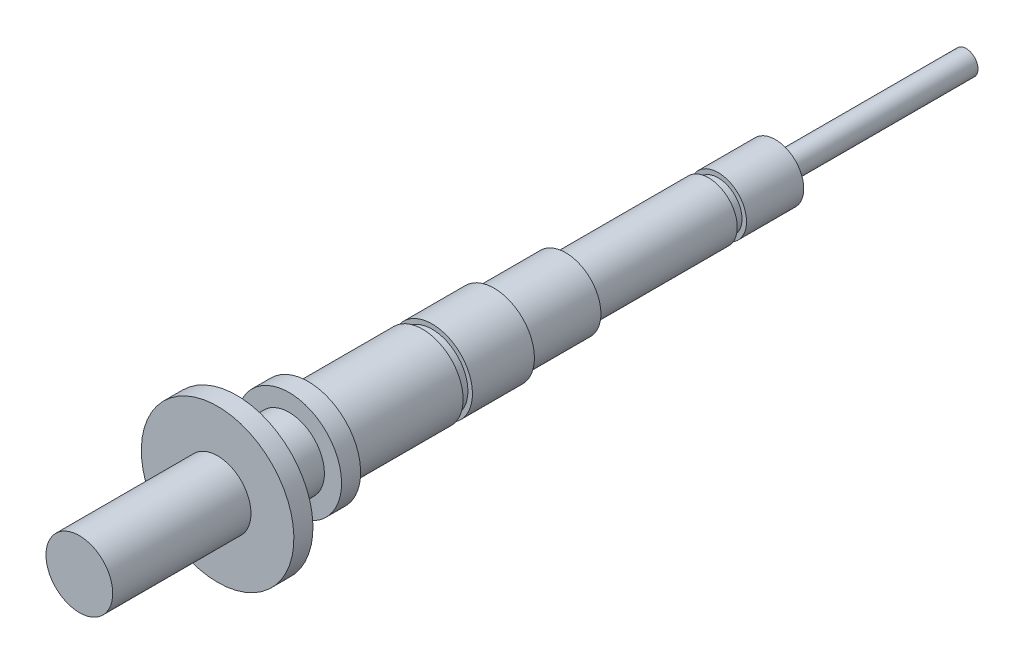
ISO-10303-21;
HEADER;
FILE_DESCRIPTION(('STEP AP214'),'2;1');
FILE_NAME('part.step','',(''),(''),'','','');
FILE_SCHEMA(('AUTOMOTIVE_DESIGN { 1 0 10303 214 1 1 1 1 }'));
ENDSEC;
DATA;
#1=APPLICATION_CONTEXT('core data for automotive mechanical design processes');
#2=APPLICATION_PROTOCOL_DEFINITION('international standard','automotive_design',2000,#1);
#3=PRODUCT_CONTEXT('',#1,'mechanical');
#4=PRODUCT('Part','Part','',(#3));
#5=PRODUCT_RELATED_PRODUCT_CATEGORY('part','',(#4));
#6=PRODUCT_DEFINITION_FORMATION('','',#4);
#7=PRODUCT_DEFINITION_CONTEXT('part definition',#1,'design');
#8=PRODUCT_DEFINITION('design','',#6,#7);
#9=PRODUCT_DEFINITION_SHAPE('','',#8);
#10=(LENGTH_UNIT() NAMED_UNIT(*) SI_UNIT(.MILLI.,.METRE.));
#11=(NAMED_UNIT(*) PLANE_ANGLE_UNIT() SI_UNIT($,.RADIAN.));
#12=(NAMED_UNIT(*) SI_UNIT($,.STERADIAN.) SOLID_ANGLE_UNIT());
#13=UNCERTAINTY_MEASURE_WITH_UNIT(LENGTH_MEASURE(1.E-05),#10,'distance_accuracy_value','');
#14=(GEOMETRIC_REPRESENTATION_CONTEXT(3) GLOBAL_UNCERTAINTY_ASSIGNED_CONTEXT((#13)) GLOBAL_UNIT_ASSIGNED_CONTEXT((#10,
#11,#12)) REPRESENTATION_CONTEXT('',''));
#15=CARTESIAN_POINT('',(0.,0.,0.));
#16=DIRECTION('',(0.,0.,1.));
#17=DIRECTION('',(1.,0.,0.));
#18=AXIS2_PLACEMENT_3D('',#15,#16,#17);
#19=CARTESIAN_POINT('',(0.,0.,93.));
#20=DIRECTION('',(0.,0.,-1.));
#21=DIRECTION('',(0.,1.,0.));
#22=AXIS2_PLACEMENT_3D('',#19,#20,#21);
#23=PLANE('',#22);
#24=CARTESIAN_POINT('',(0.,0.,93.));
#25=DIRECTION('',(0.,0.,1.));
#26=DIRECTION('',(0.,-1.,0.));
#27=AXIS2_PLACEMENT_3D('',#24,#25,#26);
#28=CIRCLE('',#27,6.99999999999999);
#29=CARTESIAN_POINT('',(0.,-6.99999999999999,93.));
#30=VERTEX_POINT('',#29);
#31=EDGE_CURVE('E10',#30,#30,#28,.T.);
#32=ORIENTED_EDGE('',*,*,#31,.T.);
#33=EDGE_LOOP('',(#32));
#34=FACE_BOUND('',#33,.T.);
#35=ADVANCED_FACE('F37',(#34),#23,.F.);
#36=CARTESIAN_POINT('',(0.,0.,126.394277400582));
#37=DIRECTION('',(0.,0.,1.));
#38=DIRECTION('',(0.,-1.,0.));
#39=AXIS2_PLACEMENT_3D('',#36,#37,#38);
#40=CYLINDRICAL_SURFACE('',#39,6.99999999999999);
#41=ORIENTED_EDGE('',*,*,#31,.F.);
#42=EDGE_LOOP('',(#41));
#43=FACE_BOUND('',#42,.T.);
#44=CARTESIAN_POINT('',(0.,0.,64.));
#45=DIRECTION('',(0.,0.,1.));
#46=DIRECTION('',(0.,-1.,0.));
#47=AXIS2_PLACEMENT_3D('',#44,#45,#46);
#48=CIRCLE('',#47,6.99999999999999);
#49=CARTESIAN_POINT('',(0.,-6.99999999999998,64.));
#50=VERTEX_POINT('',#49);
#51=EDGE_CURVE('E44',#50,#50,#48,.T.);
#52=ORIENTED_EDGE('',*,*,#51,.T.);
#53=EDGE_LOOP('',(#52));
#54=FACE_BOUND('',#53,.T.);
#55=ADVANCED_FACE('F153',(#43,#54),#40,.T.);
#56=CARTESIAN_POINT('',(0.,7.,64.));
#57=DIRECTION('',(0.,0.,-1.));
#58=DIRECTION('',(0.,1.,0.));
#59=AXIS2_PLACEMENT_3D('',#56,#57,#58);
#60=PLANE('',#59);
#61=ORIENTED_EDGE('',*,*,#51,.F.);
#62=EDGE_LOOP('',(#61));
#63=FACE_BOUND('',#62,.T.);
#64=CARTESIAN_POINT('',(0.,0.,64.));
#65=DIRECTION('',(0.,0.,1.));
#66=DIRECTION('',(0.,-1.,0.));
#67=AXIS2_PLACEMENT_3D('',#64,#65,#66);
#68=CIRCLE('',#67,16.);
#69=CARTESIAN_POINT('',(0.,-16.,64.));
#70=VERTEX_POINT('',#69);
#71=EDGE_CURVE('E49',#70,#70,#68,.T.);
#72=ORIENTED_EDGE('',*,*,#71,.T.);
#73=EDGE_LOOP('',(#72));
#74=FACE_BOUND('',#73,.T.);
#75=ADVANCED_FACE('F157',(#63,#74),#60,.F.);
#76=CARTESIAN_POINT('',(0.,0.,126.394277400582));
#77=DIRECTION('',(0.,0.,1.));
#78=DIRECTION('',(0.,-1.,0.));
#79=AXIS2_PLACEMENT_3D('',#76,#77,#78);
#80=CYLINDRICAL_SURFACE('',#79,16.);
#81=ORIENTED_EDGE('',*,*,#71,.F.);
#82=EDGE_LOOP('',(#81));
#83=FACE_BOUND('',#82,.T.);
#84=CARTESIAN_POINT('',(0.,0.,60.));
#85=DIRECTION('',(0.,0.,1.));
#86=DIRECTION('',(0.,-1.,0.));
#87=AXIS2_PLACEMENT_3D('',#84,#85,#86);
#88=CIRCLE('',#87,16.);
#89=CARTESIAN_POINT('',(0.,-16.,60.));
#90=VERTEX_POINT('',#89);
#91=EDGE_CURVE('E54',#90,#90,#88,.T.);
#92=ORIENTED_EDGE('',*,*,#91,.T.);
#93=EDGE_LOOP('',(#92));
#94=FACE_BOUND('',#93,.T.);
#95=ADVANCED_FACE('F162',(#83,#94),#80,.T.);
#96=CARTESIAN_POINT('',(0.,16.,60.));
#97=DIRECTION('',(0.,0.,1.));
#98=DIRECTION('',(0.,-1.,0.));
#99=AXIS2_PLACEMENT_3D('',#96,#97,#98);
#100=PLANE('',#99);
#101=ORIENTED_EDGE('',*,*,#91,.F.);
#102=EDGE_LOOP('',(#101));
#103=FACE_BOUND('',#102,.T.);
#104=CARTESIAN_POINT('',(0.,0.,60.));
#105=DIRECTION('',(0.,0.,1.));
#106=DIRECTION('',(0.,-1.,0.));
#107=AXIS2_PLACEMENT_3D('',#104,#105,#106);
#108=CIRCLE('',#107,7.39999999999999);
#109=CARTESIAN_POINT('',(0.,-7.39999999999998,60.));
#110=VERTEX_POINT('',#109);
#111=EDGE_CURVE('E60',#110,#110,#108,.T.);
#112=ORIENTED_EDGE('',*,*,#111,.T.);
#113=EDGE_LOOP('',(#112));
#114=FACE_BOUND('',#113,.T.);
#115=ADVANCED_FACE('F168',(#103,#114),#100,.F.);
#116=CARTESIAN_POINT('',(0.,0.,126.394277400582));
#117=DIRECTION('',(0.,0.,1.));
#118=DIRECTION('',(0.,-1.,0.));
#119=AXIS2_PLACEMENT_3D('',#116,#117,#118);
#120=CYLINDRICAL_SURFACE('',#119,7.39999999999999);
#121=ORIENTED_EDGE('',*,*,#111,.F.);
#122=EDGE_LOOP('',(#121));
#123=FACE_BOUND('',#122,.T.);
#124=CARTESIAN_POINT('',(0.,0.,49.));
#125=DIRECTION('',(0.,0.,1.));
#126=DIRECTION('',(0.,-1.,0.));
#127=AXIS2_PLACEMENT_3D('',#124,#125,#126);
#128=CIRCLE('',#127,7.39999999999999);
#129=CARTESIAN_POINT('',(0.,-7.39999999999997,49.));
#130=VERTEX_POINT('',#129);
#131=EDGE_CURVE('E64',#130,#130,#128,.T.);
#132=ORIENTED_EDGE('',*,*,#131,.T.);
#133=EDGE_LOOP('',(#132));
#134=FACE_BOUND('',#133,.T.);
#135=ADVANCED_FACE('F172',(#123,#134),#120,.T.);
#136=CARTESIAN_POINT('',(0.,7.4,49.));
#137=DIRECTION('',(0.,0.,-1.));
#138=DIRECTION('',(0.,1.,0.));
#139=AXIS2_PLACEMENT_3D('',#136,#137,#138);
#140=PLANE('',#139);
#141=ORIENTED_EDGE('',*,*,#131,.F.);
#142=EDGE_LOOP('',(#141));
#143=FACE_BOUND('',#142,.T.);
#144=CARTESIAN_POINT('',(0.,0.,49.));
#145=DIRECTION('',(0.,0.,1.));
#146=DIRECTION('',(0.,-1.,0.));
#147=AXIS2_PLACEMENT_3D('',#144,#145,#146);
#148=CIRCLE('',#147,11.);
#149=CARTESIAN_POINT('',(0.,-11.,49.));
#150=VERTEX_POINT('',#149);
#151=EDGE_CURVE('E68',#150,#150,#148,.T.);
#152=ORIENTED_EDGE('',*,*,#151,.T.);
#153=EDGE_LOOP('',(#152));
#154=FACE_BOUND('',#153,.T.);
#155=ADVANCED_FACE('F176',(#143,#154),#140,.F.);
#156=CARTESIAN_POINT('',(0.,0.,126.394277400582));
#157=DIRECTION('',(0.,0.,1.));
#158=DIRECTION('',(0.,-1.,0.));
#159=AXIS2_PLACEMENT_3D('',#156,#157,#158);
#160=CYLINDRICAL_SURFACE('',#159,11.);
#161=ORIENTED_EDGE('',*,*,#151,.F.);
#162=EDGE_LOOP('',(#161));
#163=FACE_BOUND('',#162,.T.);
#164=CARTESIAN_POINT('',(0.,0.,45.));
#165=DIRECTION('',(0.,0.,1.));
#166=DIRECTION('',(0.,-1.,0.));
#167=AXIS2_PLACEMENT_3D('',#164,#165,#166);
#168=CIRCLE('',#167,11.);
#169=CARTESIAN_POINT('',(0.,-11.,45.));
#170=VERTEX_POINT('',#169);
#171=EDGE_CURVE('E72',#170,#170,#168,.T.);
#172=ORIENTED_EDGE('',*,*,#171,.T.);
#173=EDGE_LOOP('',(#172));
#174=FACE_BOUND('',#173,.T.);
#175=ADVANCED_FACE('F180',(#163,#174),#160,.T.);
#176=CARTESIAN_POINT('',(0.,11.,45.));
#177=DIRECTION('',(0.,0.,1.));
#178=DIRECTION('',(0.,-1.,0.));
#179=AXIS2_PLACEMENT_3D('',#176,#177,#178);
#180=PLANE('',#179);
#181=ORIENTED_EDGE('',*,*,#171,.F.);
#182=EDGE_LOOP('',(#181));
#183=FACE_BOUND('',#182,.T.);
#184=CARTESIAN_POINT('',(0.,0.,45.));
#185=DIRECTION('',(0.,0.,1.));
#186=DIRECTION('',(0.,-1.,0.));
#187=AXIS2_PLACEMENT_3D('',#184,#185,#186);
#188=CIRCLE('',#187,8.49999999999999);
#189=CARTESIAN_POINT('',(0.,-8.49999999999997,45.));
#190=VERTEX_POINT('',#189);
#191=EDGE_CURVE('E76',#190,#190,#188,.T.);
#192=ORIENTED_EDGE('',*,*,#191,.T.);
#193=EDGE_LOOP('',(#192));
#194=FACE_BOUND('',#193,.T.);
#195=ADVANCED_FACE('F184',(#183,#194),#180,.F.);
#196=CARTESIAN_POINT('',(0.,0.,126.394277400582));
#197=DIRECTION('',(0.,0.,1.));
#198=DIRECTION('',(0.,-1.,0.));
#199=AXIS2_PLACEMENT_3D('',#196,#197,#198);
#200=CYLINDRICAL_SURFACE('',#199,8.49999999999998);
#201=ORIENTED_EDGE('',*,*,#191,.F.);
#202=EDGE_LOOP('',(#201));
#203=FACE_BOUND('',#202,.T.);
#204=CARTESIAN_POINT('',(0.,0.,21.));
#205=DIRECTION('',(0.,0.,1.));
#206=DIRECTION('',(0.,-1.,0.));
#207=AXIS2_PLACEMENT_3D('',#204,#205,#206);
#208=CIRCLE('',#207,8.49999999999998);
#209=CARTESIAN_POINT('',(0.,-8.49999999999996,21.));
#210=VERTEX_POINT('',#209);
#211=EDGE_CURVE('E80',#210,#210,#208,.T.);
#212=ORIENTED_EDGE('',*,*,#211,.T.);
#213=EDGE_LOOP('',(#212));
#214=FACE_BOUND('',#213,.T.);
#215=ADVANCED_FACE('F188',(#203,#214),#200,.T.);
#216=CARTESIAN_POINT('',(0.,8.45,21.));
#217=DIRECTION('',(0.,0.,1.));
#218=DIRECTION('',(0.,-1.,0.));
#219=AXIS2_PLACEMENT_3D('',#216,#217,#218);
#220=PLANE('',#219);
#221=ORIENTED_EDGE('',*,*,#211,.F.);
#222=EDGE_LOOP('',(#221));
#223=FACE_BOUND('',#222,.T.);
#224=CARTESIAN_POINT('',(0.,0.,21.));
#225=DIRECTION('',(0.,0.,1.));
#226=DIRECTION('',(0.,-1.,0.));
#227=AXIS2_PLACEMENT_3D('',#224,#225,#226);
#228=CIRCLE('',#227,7.49999999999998);
#229=CARTESIAN_POINT('',(0.,-7.49999999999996,21.));
#230=VERTEX_POINT('',#229);
#231=EDGE_CURVE('E84',#230,#230,#228,.T.);
#232=ORIENTED_EDGE('',*,*,#231,.T.);
#233=EDGE_LOOP('',(#232));
#234=FACE_BOUND('',#233,.T.);
#235=ADVANCED_FACE('F192',(#223,#234),#220,.F.);
#236=CARTESIAN_POINT('',(0.,0.,126.394277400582));
#237=DIRECTION('',(0.,0.,1.));
#238=DIRECTION('',(0.,-1.,0.));
#239=AXIS2_PLACEMENT_3D('',#236,#237,#238);
#240=CYLINDRICAL_SURFACE('',#239,7.49999999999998);
#241=ORIENTED_EDGE('',*,*,#231,.F.);
#242=EDGE_LOOP('',(#241));
#243=FACE_BOUND('',#242,.T.);
#244=CARTESIAN_POINT('',(0.,0.,19.));
#245=DIRECTION('',(0.,0.,1.));
#246=DIRECTION('',(0.,-1.,0.));
#247=AXIS2_PLACEMENT_3D('',#244,#245,#246);
#248=CIRCLE('',#247,7.49999999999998);
#249=CARTESIAN_POINT('',(0.,-7.49999999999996,19.));
#250=VERTEX_POINT('',#249);
#251=EDGE_CURVE('E88',#250,#250,#248,.T.);
#252=ORIENTED_EDGE('',*,*,#251,.T.);
#253=EDGE_LOOP('',(#252));
#254=FACE_BOUND('',#253,.T.);
#255=ADVANCED_FACE('F196',(#243,#254),#240,.T.);
#256=CARTESIAN_POINT('',(0.,7.5,19.));
#257=DIRECTION('',(0.,0.,-1.));
#258=DIRECTION('',(0.,1.,0.));
#259=AXIS2_PLACEMENT_3D('',#256,#257,#258);
#260=PLANE('',#259);
#261=ORIENTED_EDGE('',*,*,#251,.F.);
#262=EDGE_LOOP('',(#261));
#263=FACE_BOUND('',#262,.T.);
#264=CARTESIAN_POINT('',(0.,0.,19.));
#265=DIRECTION('',(0.,0.,1.));
#266=DIRECTION('',(0.,-1.,0.));
#267=AXIS2_PLACEMENT_3D('',#264,#265,#266);
#268=CIRCLE('',#267,8.44999999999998);
#269=CARTESIAN_POINT('',(0.,-8.44999999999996,19.));
#270=VERTEX_POINT('',#269);
#271=EDGE_CURVE('E92',#270,#270,#268,.T.);
#272=ORIENTED_EDGE('',*,*,#271,.T.);
#273=EDGE_LOOP('',(#272));
#274=FACE_BOUND('',#273,.T.);
#275=ADVANCED_FACE('F200',(#263,#274),#260,.F.);
#276=CARTESIAN_POINT('',(0.,0.,126.394277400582));
#277=DIRECTION('',(0.,0.,1.));
#278=DIRECTION('',(0.,-1.,0.));
#279=AXIS2_PLACEMENT_3D('',#276,#277,#278);
#280=CYLINDRICAL_SURFACE('',#279,8.44999999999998);
#281=ORIENTED_EDGE('',*,*,#271,.F.);
#282=EDGE_LOOP('',(#281));
#283=FACE_BOUND('',#282,.T.);
#284=CARTESIAN_POINT('',(0.,0.,6.00000000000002));
#285=DIRECTION('',(0.,0.,1.));
#286=DIRECTION('',(0.,-1.,0.));
#287=AXIS2_PLACEMENT_3D('',#284,#285,#286);
#288=CIRCLE('',#287,8.44999999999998);
#289=CARTESIAN_POINT('',(0.,-8.44999999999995,6.00000000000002));
#290=VERTEX_POINT('',#289);
#291=EDGE_CURVE('E96',#290,#290,#288,.T.);
#292=ORIENTED_EDGE('',*,*,#291,.T.);
#293=EDGE_LOOP('',(#292));
#294=FACE_BOUND('',#293,.T.);
#295=ADVANCED_FACE('F204',(#283,#294),#280,.T.);
#296=CARTESIAN_POINT('',(0.,8.45,6.00000000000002));
#297=DIRECTION('',(0.,0.,1.));
#298=DIRECTION('',(0.,-1.,0.));
#299=AXIS2_PLACEMENT_3D('',#296,#297,#298);
#300=PLANE('',#299);
#301=ORIENTED_EDGE('',*,*,#291,.F.);
#302=EDGE_LOOP('',(#301));
#303=FACE_BOUND('',#302,.T.);
#304=CARTESIAN_POINT('',(0.,0.,6.00000000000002));
#305=DIRECTION('',(0.,0.,1.));
#306=DIRECTION('',(0.,-1.,0.));
#307=AXIS2_PLACEMENT_3D('',#304,#305,#306);
#308=CIRCLE('',#307,7.39999999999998);
#309=CARTESIAN_POINT('',(0.,-7.39999999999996,6.00000000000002));
#310=VERTEX_POINT('',#309);
#311=EDGE_CURVE('E100',#310,#310,#308,.T.);
#312=ORIENTED_EDGE('',*,*,#311,.T.);
#313=EDGE_LOOP('',(#312));
#314=FACE_BOUND('',#313,.T.);
#315=ADVANCED_FACE('F208',(#303,#314),#300,.F.);
#316=CARTESIAN_POINT('',(0.,0.,126.394277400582));
#317=DIRECTION('',(0.,0.,1.));
#318=DIRECTION('',(0.,-1.,0.));
#319=AXIS2_PLACEMENT_3D('',#316,#317,#318);
#320=CYLINDRICAL_SURFACE('',#319,7.39999999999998);
#321=ORIENTED_EDGE('',*,*,#311,.F.);
#322=EDGE_LOOP('',(#321));
#323=FACE_BOUND('',#322,.T.);
#324=CARTESIAN_POINT('',(0.,0.,-9.00000000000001));
#325=DIRECTION('',(0.,0.,1.));
#326=DIRECTION('',(0.,-1.,0.));
#327=AXIS2_PLACEMENT_3D('',#324,#325,#326);
#328=CIRCLE('',#327,7.39999999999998);
#329=CARTESIAN_POINT('',(0.,-7.39999999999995,-9.00000000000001));
#330=VERTEX_POINT('',#329);
#331=EDGE_CURVE('E104',#330,#330,#328,.T.);
#332=ORIENTED_EDGE('',*,*,#331,.T.);
#333=EDGE_LOOP('',(#332));
#334=FACE_BOUND('',#333,.T.);
#335=ADVANCED_FACE('F212',(#323,#334),#320,.T.);
#336=CARTESIAN_POINT('',(0.,7.4,-9.00000000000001));
#337=DIRECTION('',(0.,0.,1.));
#338=DIRECTION('',(0.,-1.,0.));
#339=AXIS2_PLACEMENT_3D('',#336,#337,#338);
#340=PLANE('',#339);
#341=ORIENTED_EDGE('',*,*,#331,.F.);
#342=EDGE_LOOP('',(#341));
#343=FACE_BOUND('',#342,.T.);
#344=CARTESIAN_POINT('',(0.,0.,-9.00000000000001));
#345=DIRECTION('',(0.,0.,1.));
#346=DIRECTION('',(0.,-1.,0.));
#347=AXIS2_PLACEMENT_3D('',#344,#345,#346);
#348=CIRCLE('',#347,5.99999999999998);
#349=CARTESIAN_POINT('',(0.,-5.99999999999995,-9.00000000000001));
#350=VERTEX_POINT('',#349);
#351=EDGE_CURVE('E108',#350,#350,#348,.T.);
#352=ORIENTED_EDGE('',*,*,#351,.T.);
#353=EDGE_LOOP('',(#352));
#354=FACE_BOUND('',#353,.T.);
#355=ADVANCED_FACE('F216',(#343,#354),#340,.F.);
#356=CARTESIAN_POINT('',(0.,0.,126.394277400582));
#357=DIRECTION('',(0.,0.,1.));
#358=DIRECTION('',(0.,-1.,0.));
#359=AXIS2_PLACEMENT_3D('',#356,#357,#358);
#360=CYLINDRICAL_SURFACE('',#359,5.99999999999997);
#361=ORIENTED_EDGE('',*,*,#351,.F.);
#362=EDGE_LOOP('',(#361));
#363=FACE_BOUND('',#362,.T.);
#364=CARTESIAN_POINT('',(0.,0.,-39.));
#365=DIRECTION('',(0.,0.,1.));
#366=DIRECTION('',(0.,-1.,0.));
#367=AXIS2_PLACEMENT_3D('',#364,#365,#366);
#368=CIRCLE('',#367,5.99999999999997);
#369=CARTESIAN_POINT('',(0.,-5.99999999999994,-39.));
#370=VERTEX_POINT('',#369);
#371=EDGE_CURVE('E112',#370,#370,#368,.T.);
#372=ORIENTED_EDGE('',*,*,#371,.T.);
#373=EDGE_LOOP('',(#372));
#374=FACE_BOUND('',#373,.T.);
#375=ADVANCED_FACE('F220',(#363,#374),#360,.T.);
#376=CARTESIAN_POINT('',(0.,6.,-39.));
#377=DIRECTION('',(0.,0.,1.));
#378=DIRECTION('',(0.,-1.,0.));
#379=AXIS2_PLACEMENT_3D('',#376,#377,#378);
#380=PLANE('',#379);
#381=ORIENTED_EDGE('',*,*,#371,.F.);
#382=EDGE_LOOP('',(#381));
#383=FACE_BOUND('',#382,.T.);
#384=CARTESIAN_POINT('',(0.,0.,-39.));
#385=DIRECTION('',(0.,0.,1.));
#386=DIRECTION('',(0.,-1.,0.));
#387=AXIS2_PLACEMENT_3D('',#384,#385,#386);
#388=CIRCLE('',#387,4.99999999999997);
#389=CARTESIAN_POINT('',(0.,-4.99999999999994,-39.));
#390=VERTEX_POINT('',#389);
#391=EDGE_CURVE('E116',#390,#390,#388,.T.);
#392=ORIENTED_EDGE('',*,*,#391,.T.);
#393=EDGE_LOOP('',(#392));
#394=FACE_BOUND('',#393,.T.);
#395=ADVANCED_FACE('F224',(#383,#394),#380,.F.);
#396=CARTESIAN_POINT('',(0.,0.,126.394277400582));
#397=DIRECTION('',(0.,0.,1.));
#398=DIRECTION('',(0.,-1.,0.));
#399=AXIS2_PLACEMENT_3D('',#396,#397,#398);
#400=CYLINDRICAL_SURFACE('',#399,4.99999999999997);
#401=ORIENTED_EDGE('',*,*,#391,.F.);
#402=EDGE_LOOP('',(#401));
#403=FACE_BOUND('',#402,.T.);
#404=CARTESIAN_POINT('',(0.,0.,-41.));
#405=DIRECTION('',(0.,0.,1.));
#406=DIRECTION('',(0.,-1.,0.));
#407=AXIS2_PLACEMENT_3D('',#404,#405,#406);
#408=CIRCLE('',#407,4.99999999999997);
#409=CARTESIAN_POINT('',(0.,-4.99999999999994,-41.));
#410=VERTEX_POINT('',#409);
#411=EDGE_CURVE('E120',#410,#410,#408,.T.);
#412=ORIENTED_EDGE('',*,*,#411,.T.);
#413=EDGE_LOOP('',(#412));
#414=FACE_BOUND('',#413,.T.);
#415=ADVANCED_FACE('F228',(#403,#414),#400,.T.);
#416=CARTESIAN_POINT('',(0.,5.,-41.));
#417=DIRECTION('',(0.,0.,-1.));
#418=DIRECTION('',(0.,1.,0.));
#419=AXIS2_PLACEMENT_3D('',#416,#417,#418);
#420=PLANE('',#419);
#421=ORIENTED_EDGE('',*,*,#411,.F.);
#422=EDGE_LOOP('',(#421));
#423=FACE_BOUND('',#422,.T.);
#424=CARTESIAN_POINT('',(0.,0.,-41.));
#425=DIRECTION('',(0.,0.,1.));
#426=DIRECTION('',(0.,-1.,0.));
#427=AXIS2_PLACEMENT_3D('',#424,#425,#426);
#428=CIRCLE('',#427,5.94999999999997);
#429=CARTESIAN_POINT('',(0.,-5.94999999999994,-41.));
#430=VERTEX_POINT('',#429);
#431=EDGE_CURVE('E124',#430,#430,#428,.T.);
#432=ORIENTED_EDGE('',*,*,#431,.T.);
#433=EDGE_LOOP('',(#432));
#434=FACE_BOUND('',#433,.T.);
#435=ADVANCED_FACE('F232',(#423,#434),#420,.F.);
#436=CARTESIAN_POINT('',(0.,0.,126.394277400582));
#437=DIRECTION('',(0.,0.,1.));
#438=DIRECTION('',(0.,-1.,0.));
#439=AXIS2_PLACEMENT_3D('',#436,#437,#438);
#440=CYLINDRICAL_SURFACE('',#439,5.94999999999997);
#441=ORIENTED_EDGE('',*,*,#431,.F.);
#442=EDGE_LOOP('',(#441));
#443=FACE_BOUND('',#442,.T.);
#444=CARTESIAN_POINT('',(0.,0.,-53.));
#445=DIRECTION('',(0.,0.,1.));
#446=DIRECTION('',(0.,-1.,0.));
#447=AXIS2_PLACEMENT_3D('',#444,#445,#446);
#448=CIRCLE('',#447,5.94999999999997);
#449=CARTESIAN_POINT('',(0.,-5.94999999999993,-53.));
#450=VERTEX_POINT('',#449);
#451=EDGE_CURVE('E128',#450,#450,#448,.T.);
#452=ORIENTED_EDGE('',*,*,#451,.T.);
#453=EDGE_LOOP('',(#452));
#454=FACE_BOUND('',#453,.T.);
#455=ADVANCED_FACE('F236',(#443,#454),#440,.T.);
#456=CARTESIAN_POINT('',(0.,5.95,-53.));
#457=DIRECTION('',(0.,0.,1.));
#458=DIRECTION('',(0.,-1.,0.));
#459=AXIS2_PLACEMENT_3D('',#456,#457,#458);
#460=PLANE('',#459);
#461=ORIENTED_EDGE('',*,*,#451,.F.);
#462=EDGE_LOOP('',(#461));
#463=FACE_BOUND('',#462,.T.);
#464=CARTESIAN_POINT('',(0.,0.,-53.));
#465=DIRECTION('',(0.,0.,1.));
#466=DIRECTION('',(0.,-1.,0.));
#467=AXIS2_PLACEMENT_3D('',#464,#465,#466);
#468=CIRCLE('',#467,2.49999999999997);
#469=CARTESIAN_POINT('',(0.,-2.49999999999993,-53.));
#470=VERTEX_POINT('',#469);
#471=EDGE_CURVE('E132',#470,#470,#468,.T.);
#472=ORIENTED_EDGE('',*,*,#471,.T.);
#473=EDGE_LOOP('',(#472));
#474=FACE_BOUND('',#473,.T.);
#475=ADVANCED_FACE('F149',(#463,#474),#460,.F.);
#476=CARTESIAN_POINT('',(0.,0.,126.394277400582));
#477=DIRECTION('',(0.,0.,1.));
#478=DIRECTION('',(0.,-1.,0.));
#479=AXIS2_PLACEMENT_3D('',#476,#477,#478);
#480=CYLINDRICAL_SURFACE('',#479,2.49999999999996);
#481=ORIENTED_EDGE('',*,*,#471,.F.);
#482=EDGE_LOOP('',(#481));
#483=FACE_BOUND('',#482,.T.);
#484=CARTESIAN_POINT('',(0.,0.,-93.));
#485=DIRECTION('',(0.,0.,1.));
#486=DIRECTION('',(0.,-1.,0.));
#487=AXIS2_PLACEMENT_3D('',#484,#485,#486);
#488=CIRCLE('',#487,2.49999999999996);
#489=CARTESIAN_POINT('',(0.,-2.49999999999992,-93.));
#490=VERTEX_POINT('',#489);
#491=EDGE_CURVE('E136',#490,#490,#488,.T.);
#492=ORIENTED_EDGE('',*,*,#491,.T.);
#493=EDGE_LOOP('',(#492));
#494=FACE_BOUND('',#493,.T.);
#495=ADVANCED_FACE('F141',(#483,#494),#480,.T.);
#496=CARTESIAN_POINT('',(0.,2.5,-93.));
#497=DIRECTION('',(0.,0.,1.));
#498=DIRECTION('',(0.,-1.,0.));
#499=AXIS2_PLACEMENT_3D('',#496,#497,#498);
#500=PLANE('',#499);
#501=ORIENTED_EDGE('',*,*,#491,.F.);
#502=EDGE_LOOP('',(#501));
#503=FACE_BOUND('',#502,.T.);
#504=ADVANCED_FACE('F143',(#503),#500,.F.);
#505=CLOSED_SHELL('',(#35,#55,#75,#95,#115,#135,#155,#175,#195,#215,#235,#255,#275,#295,#315,
#335,#355,#375,#395,#415,#435,#455,#475,#495,#504));
#506=MANIFOLD_SOLID_BREP('B2',#505);
#507=ADVANCED_BREP_SHAPE_REPRESENTATION('',(#18,#506),#14);
#508=SHAPE_DEFINITION_REPRESENTATION(#9,#507);
ENDSEC;
END-ISO-10303-21;
